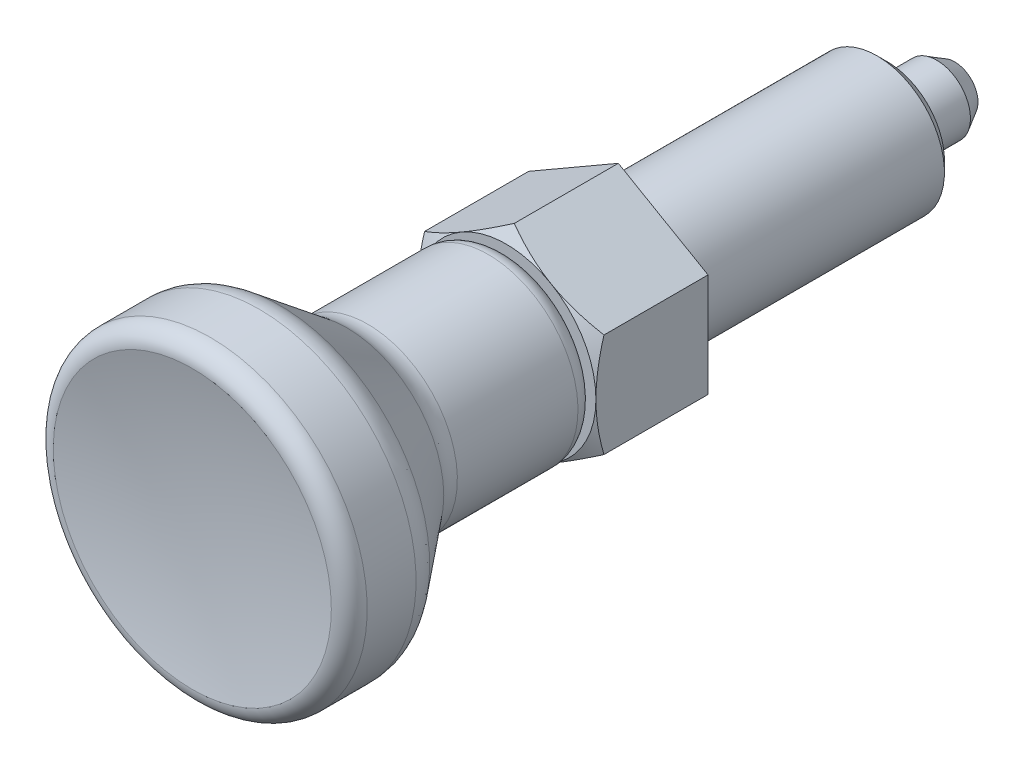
ISO-10303-21;
HEADER;
FILE_DESCRIPTION(('STEP AP214'),'2;1');
FILE_NAME('part.step','',(''),(''),'','','');
FILE_SCHEMA(('AUTOMOTIVE_DESIGN { 1 0 10303 214 1 1 1 1 }'));
ENDSEC;
DATA;
#1=APPLICATION_CONTEXT('core data for automotive mechanical design processes');
#2=APPLICATION_PROTOCOL_DEFINITION('international standard','automotive_design',2000,#1);
#3=PRODUCT_CONTEXT('',#1,'mechanical');
#4=PRODUCT('Part','Part','',(#3));
#5=PRODUCT_RELATED_PRODUCT_CATEGORY('part','',(#4));
#6=PRODUCT_DEFINITION_FORMATION('','',#4);
#7=PRODUCT_DEFINITION_CONTEXT('part definition',#1,'design');
#8=PRODUCT_DEFINITION('design','',#6,#7);
#9=PRODUCT_DEFINITION_SHAPE('','',#8);
#10=(LENGTH_UNIT() NAMED_UNIT(*) SI_UNIT(.MILLI.,.METRE.));
#11=(NAMED_UNIT(*) PLANE_ANGLE_UNIT() SI_UNIT($,.RADIAN.));
#12=(NAMED_UNIT(*) SI_UNIT($,.STERADIAN.) SOLID_ANGLE_UNIT());
#13=UNCERTAINTY_MEASURE_WITH_UNIT(LENGTH_MEASURE(1.E-05),#10,'distance_accuracy_value','');
#14=(GEOMETRIC_REPRESENTATION_CONTEXT(3) GLOBAL_UNCERTAINTY_ASSIGNED_CONTEXT((#13)) GLOBAL_UNIT_ASSIGNED_CONTEXT((#10,
#11,#12)) REPRESENTATION_CONTEXT('',''));
#15=CARTESIAN_POINT('',(0.,0.,0.));
#16=DIRECTION('',(0.,0.,1.));
#17=DIRECTION('',(1.,0.,0.));
#18=AXIS2_PLACEMENT_3D('',#15,#16,#17);
#19=CARTESIAN_POINT('',(0.,0.,3.2679491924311));
#20=DIRECTION('',(0.,0.,-1.));
#21=DIRECTION('',(1.,0.,0.));
#22=AXIS2_PLACEMENT_3D('',#19,#20,#21);
#23=CONICAL_SURFACE('',#22,7.,1.0471975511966);
#24=CARTESIAN_POINT('',(-4.,6.31761832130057,2.9922916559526));
#25=CARTESIAN_POINT('',(-4.,6.14192520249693,3.07797180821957));
#26=CARTESIAN_POINT('',(-4.,5.96584084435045,3.16286285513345));
#27=CARTESIAN_POINT('',(-4.,5.61268201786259,3.33062511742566));
#28=CARTESIAN_POINT('',(-4.,5.4356074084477,3.4134960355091));
#29=CARTESIAN_POINT('',(-4.,5.07940162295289,3.57716927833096));
#30=CARTESIAN_POINT('',(-4.,4.9002645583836,3.65795883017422));
#31=CARTESIAN_POINT('',(-4.,4.54060511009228,3.81638112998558));
#32=CARTESIAN_POINT('',(-4.,4.36008278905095,3.89401401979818));
#33=CARTESIAN_POINT('',(-4.,3.9911078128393,4.04790350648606));
#34=CARTESIAN_POINT('',(-4.,3.80259647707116,4.12402014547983));
#35=CARTESIAN_POINT('',(-4.,3.42341084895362,4.27076449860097));
#36=CARTESIAN_POINT('',(-4.,3.23273632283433,4.34139161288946));
#37=CARTESIAN_POINT('',(-4.,2.84924251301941,4.47538599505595));
#38=CARTESIAN_POINT('',(-4.,2.65642808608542,4.5387670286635));
#39=CARTESIAN_POINT('',(-4.,2.2680353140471,4.65631131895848));
#40=CARTESIAN_POINT('',(-4.,2.07245782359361,4.71047736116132));
#41=CARTESIAN_POINT('',(-4.,1.67954158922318,4.80677280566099));
#42=CARTESIAN_POINT('',(-4.,1.48222021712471,4.84897182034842));
#43=CARTESIAN_POINT('',(-4.,1.08500777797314,4.91903453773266));
#44=CARTESIAN_POINT('',(-4.,0.885116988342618,4.94689977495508));
#45=CARTESIAN_POINT('',(-4.,0.48641972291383,4.9857133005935));
#46=CARTESIAN_POINT('',(-4.,0.287635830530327,4.9968878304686));
#47=CARTESIAN_POINT('',(-4.,-0.110173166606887,5.00197590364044));
#48=CARTESIAN_POINT('',(-4.,-0.309198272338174,4.99588937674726));
#49=CARTESIAN_POINT('',(-4.,-0.643785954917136,4.97158820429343));
#50=CARTESIAN_POINT('',(-4.,-0.77969019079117,4.95777215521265));
#51=CARTESIAN_POINT('',(-4.,-1.05057142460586,4.92289191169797));
#52=CARTESIAN_POINT('',(-4.,-1.18554830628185,4.90182682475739));
#53=CARTESIAN_POINT('',(-4.,-1.58887088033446,4.82885810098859));
#54=CARTESIAN_POINT('',(-4.,-1.8554737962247,4.76719214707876));
#55=CARTESIAN_POINT('',(-4.,-2.2542740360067,4.65940087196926));
#56=CARTESIAN_POINT('',(-4.,-2.38851478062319,4.62039718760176));
#57=CARTESIAN_POINT('',(-4.,-2.65569482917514,4.53812259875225));
#58=CARTESIAN_POINT('',(-4.,-2.78863412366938,4.49485166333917));
#59=CARTESIAN_POINT('',(-4.,-3.05324930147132,4.40475468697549));
#60=CARTESIAN_POINT('',(-4.,-3.18492553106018,4.35792965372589));
#61=CARTESIAN_POINT('',(-4.,-3.44717271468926,4.26129676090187));
#62=CARTESIAN_POINT('',(-4.,-3.57774368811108,4.21148895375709));
#63=CARTESIAN_POINT('',(-4.,-3.90838583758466,4.08171887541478));
#64=CARTESIAN_POINT('',(-4.,-4.10778247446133,4.00004019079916));
#65=CARTESIAN_POINT('',(-4.,-4.50466534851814,3.83215118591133));
#66=CARTESIAN_POINT('',(-4.,-4.70215141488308,3.74594046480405));
#67=CARTESIAN_POINT('',(-4.,-5.09560571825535,3.56998451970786));
#68=CARTESIAN_POINT('',(-4.,-5.29157350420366,3.48023829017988));
#69=CARTESIAN_POINT('',(-4.,-5.68222178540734,3.29798176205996));
#70=CARTESIAN_POINT('',(-4.,-5.87690224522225,3.2054713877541));
#71=CARTESIAN_POINT('',(-4.,-6.45989965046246,2.92441834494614));
#72=CARTESIAN_POINT('',(-4.,-6.84663497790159,2.73259823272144));
#73=CARTESIAN_POINT('',(-4.,-7.61714397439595,2.34330251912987));
#74=CARTESIAN_POINT('',(-4.,-8.00091813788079,2.14582788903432));
#75=CARTESIAN_POINT('',(-4.,-8.72975807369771,1.76604091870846));
#76=CARTESIAN_POINT('',(-4.,-9.07501124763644,1.58408754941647));
#77=CARTESIAN_POINT('',(-4.,-9.76427122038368,1.21779786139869));
#78=CARTESIAN_POINT('',(-4.,-10.1082779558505,1.03346142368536));
#79=CARTESIAN_POINT('',(-4.,-10.7942722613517,0.663568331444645));
#80=CARTESIAN_POINT('',(-4.,-11.1362627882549,0.478017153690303));
#81=CARTESIAN_POINT('',(-4.,-11.8194584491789,0.105530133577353));
#82=CARTESIAN_POINT('',(-4.,-12.1606636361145,-0.0814056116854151));
#83=CARTESIAN_POINT('',(-4.,-12.5015869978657,-0.26885020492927));
#84=B_SPLINE_CURVE_WITH_KNOTS('',3,(#24,#25,#26,#27,#28,#29,#30,#31,#32,#33,#34,#35,#36,#37,#38,
#39,#40,#41,#42,#43,#44,#45,#46,#47,#48,#49,#50,#51,#52,#53,#54,#55,#56,#57,#58,#59,#60,#61,#62,
#63,#64,#65,#66,#67,#68,#69,#70,#71,#72,#73,#74,#75,#76,#77,#78,#79,#80,#81,#82,#83),
.UNSPECIFIED.,.F.,.F.,(4,2,2,2,2,2,2,2,2,2,2,2,2,2,2,2,2,2,2,2,2,2,2,2,2,2,2,2,2,4),(0.,
0.586421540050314,1.1729288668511,1.76244097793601,2.35192656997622,2.96175582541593,
3.5716516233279,4.18036881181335,4.78890166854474,5.39381845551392,5.99867046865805,
6.59524689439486,7.1918257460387,7.60144321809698,8.01111114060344,8.83085062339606,
9.25018861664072,9.66952964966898,10.0887522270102,10.5079674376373,11.1543192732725,
11.8007283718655,12.447322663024,13.0939346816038,14.3889300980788,15.6837043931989,
16.8544868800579,18.0253280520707,19.1925780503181,20.3597469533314),.UNSPECIFIED.);
#85=CARTESIAN_POINT('',(-4.,-2.3094010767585,4.64273441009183));
#86=VERTEX_POINT('',#85);
#87=CARTESIAN_POINT('',(-4.,0.,5.));
#88=VERTEX_POINT('',#87);
#89=EDGE_CURVE('E9',#86,#88,#84,.F.);
#90=ORIENTED_EDGE('',*,*,#89,.F.);
#91=CARTESIAN_POINT('',(0.000200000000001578,-4.61891762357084,4.64266774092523));
#92=CARTESIAN_POINT('',(-0.175579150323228,-4.5174314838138,4.70128212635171));
#93=CARTESIAN_POINT('',(-0.352875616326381,-4.41506932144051,4.75458967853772));
#94=CARTESIAN_POINT('',(-0.710538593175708,-4.20857250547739,4.84763832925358));
#95=CARTESIAN_POINT('',(-0.890911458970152,-4.10443418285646,4.88734651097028));
#96=CARTESIAN_POINT('',(-1.24942181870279,-3.89744813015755,4.9491577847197));
#97=CARTESIAN_POINT('',(-1.42750415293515,-3.79463224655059,4.97167226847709));
#98=CARTESIAN_POINT('',(-1.78450671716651,-3.58851671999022,4.9985493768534));
#99=CARTESIAN_POINT('',(-1.9634256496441,-3.48521782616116,5.00293425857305));
#100=CARTESIAN_POINT('',(-2.29774284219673,-3.29219970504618,4.99380992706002));
#101=CARTESIAN_POINT('',(-2.45319115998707,-3.20245157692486,4.98254104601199));
#102=CARTESIAN_POINT('',(-2.76307505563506,-3.02354002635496,4.94682600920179));
#103=CARTESIAN_POINT('',(-2.91750956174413,-2.93437722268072,4.92236765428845));
#104=CARTESIAN_POINT('',(-3.22803232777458,-2.75509682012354,4.86122393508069));
#105=CARTESIAN_POINT('',(-3.3840812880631,-2.6650019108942,4.82427939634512));
#106=CARTESIAN_POINT('',(-3.69385183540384,-2.486155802,4.74042992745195));
#107=CARTESIAN_POINT('',(-3.84757739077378,-2.39740231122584,4.69354469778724));
#108=CARTESIAN_POINT('',(-4.0002,-2.30928560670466,4.64266774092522));
#109=B_SPLINE_CURVE_WITH_KNOTS('',3,(#91,#92,#93,#94,#95,#96,#97,#98,#99,#100,#101,#102,#103,
#104,#105,#106,#107,#108),.UNSPECIFIED.,.F.,.F.,(4,2,2,2,2,2,2,2,4),(0.,0.634047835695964,
1.26961969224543,1.88946157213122,2.50854226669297,3.04757825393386,3.58711366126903,
4.13861653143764,4.68903648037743),.UNSPECIFIED.);
#110=CARTESIAN_POINT('',(-2.,-3.46410161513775,5.));
#111=VERTEX_POINT('',#110);
#112=EDGE_CURVE('E206',#111,#86,#109,.T.);
#113=ORIENTED_EDGE('',*,*,#112,.F.);
#114=CARTESIAN_POINT('',(0.,0.,5.));
#115=DIRECTION('',(0.,0.,1.));
#116=DIRECTION('',(-1.,0.,0.));
#117=AXIS2_PLACEMENT_3D('',#114,#115,#116);
#118=CIRCLE('',#117,4.);
#119=EDGE_CURVE('E124',#88,#111,#118,.T.);
#120=ORIENTED_EDGE('',*,*,#119,.F.);
#121=EDGE_LOOP('',(#90,#113,#120));
#122=FACE_BOUND('',#121,.T.);
#123=ADVANCED_FACE('F14',(#122),#23,.T.);
#124=CARTESIAN_POINT('',(-4.,2.3094010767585,4.64273441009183));
#125=VERTEX_POINT('',#124);
#126=EDGE_CURVE('E18',#88,#125,#84,.F.);
#127=ORIENTED_EDGE('',*,*,#126,.F.);
#128=CARTESIAN_POINT('',(-2.,3.46410161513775,5.));
#129=VERTEX_POINT('',#128);
#130=EDGE_CURVE('E116',#129,#88,#118,.T.);
#131=ORIENTED_EDGE('',*,*,#130,.F.);
#132=CARTESIAN_POINT('',(-4.0002,2.30928560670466,4.64266774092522));
#133=CARTESIAN_POINT('',(-3.82442084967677,2.4107717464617,4.7012821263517));
#134=CARTESIAN_POINT('',(-3.64712438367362,2.51313390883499,4.75458967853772));
#135=CARTESIAN_POINT('',(-3.28946140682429,2.71963072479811,4.84763832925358));
#136=CARTESIAN_POINT('',(-3.10908854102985,2.82376904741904,4.88734651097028));
#137=CARTESIAN_POINT('',(-2.75057818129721,3.03075510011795,4.9491577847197));
#138=CARTESIAN_POINT('',(-2.57249584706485,3.13357098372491,4.97167226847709));
#139=CARTESIAN_POINT('',(-2.21549328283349,3.33968651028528,4.99854937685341));
#140=CARTESIAN_POINT('',(-2.03657435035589,3.44298540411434,5.00293425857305));
#141=CARTESIAN_POINT('',(-1.70225715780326,3.63600352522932,4.99380992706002));
#142=CARTESIAN_POINT('',(-1.54680884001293,3.72575165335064,4.98254104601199));
#143=CARTESIAN_POINT('',(-1.23692494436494,3.90466320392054,4.94682600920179));
#144=CARTESIAN_POINT('',(-1.08249043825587,3.99382600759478,4.92236765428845));
#145=CARTESIAN_POINT('',(-0.771967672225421,4.17310641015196,4.8612239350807));
#146=CARTESIAN_POINT('',(-0.615918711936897,4.2632013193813,4.82427939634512));
#147=CARTESIAN_POINT('',(-0.30614816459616,4.4420474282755,4.74042992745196));
#148=CARTESIAN_POINT('',(-0.152422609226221,4.53080091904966,4.69354469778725));
#149=CARTESIAN_POINT('',(0.000199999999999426,4.61891762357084,4.64266774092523));
#150=B_SPLINE_CURVE_WITH_KNOTS('',3,(#132,#133,#134,#135,#136,#137,#138,#139,#140,#141,#142,
#143,#144,#145,#146,#147,#148,#149),.UNSPECIFIED.,.F.,.F.,(4,2,2,2,2,2,2,2,4),(0.,
0.634047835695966,1.26961969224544,1.88946157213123,2.50854226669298,3.04757825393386,
3.58711366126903,4.13861653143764,4.68903648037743),.UNSPECIFIED.);
#151=EDGE_CURVE('E265',#125,#129,#150,.T.);
#152=ORIENTED_EDGE('',*,*,#151,.F.);
#153=EDGE_LOOP('',(#127,#131,#152));
#154=FACE_BOUND('',#153,.T.);
#155=ADVANCED_FACE('F228',(#154),#23,.T.);
#156=CARTESIAN_POINT('',(0.,4.618802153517,4.64273441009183));
#157=VERTEX_POINT('',#156);
#158=EDGE_CURVE('E112',#129,#157,#150,.T.);
#159=ORIENTED_EDGE('',*,*,#158,.F.);
#160=CARTESIAN_POINT('',(2.,3.46410161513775,5.));
#161=VERTEX_POINT('',#160);
#162=EDGE_CURVE('E110',#161,#129,#118,.T.);
#163=ORIENTED_EDGE('',*,*,#162,.F.);
#164=CARTESIAN_POINT('',(-0.000200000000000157,4.61891762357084,4.64266774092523));
#165=CARTESIAN_POINT('',(0.17557915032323,4.5174314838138,4.70128212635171));
#166=CARTESIAN_POINT('',(0.352875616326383,4.41506932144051,4.75458967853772));
#167=CARTESIAN_POINT('',(0.710538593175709,4.20857250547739,4.84763832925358));
#168=CARTESIAN_POINT('',(0.890911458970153,4.10443418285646,4.88734651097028));
#169=CARTESIAN_POINT('',(1.24942181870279,3.89744813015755,4.94915778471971));
#170=CARTESIAN_POINT('',(1.42750415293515,3.79463224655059,4.97167226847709));
#171=CARTESIAN_POINT('',(1.78450671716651,3.58851671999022,4.99854937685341));
#172=CARTESIAN_POINT('',(1.9634256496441,3.48521782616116,5.00293425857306));
#173=CARTESIAN_POINT('',(2.29774284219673,3.29219970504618,4.99380992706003));
#174=CARTESIAN_POINT('',(2.45319115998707,3.20245157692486,4.982541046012));
#175=CARTESIAN_POINT('',(2.76307505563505,3.02354002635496,4.94682600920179));
#176=CARTESIAN_POINT('',(2.91750956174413,2.93437722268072,4.92236765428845));
#177=CARTESIAN_POINT('',(3.22803232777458,2.75509682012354,4.8612239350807));
#178=CARTESIAN_POINT('',(3.3840812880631,2.6650019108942,4.82427939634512));
#179=CARTESIAN_POINT('',(3.69385183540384,2.486155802,4.74042992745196));
#180=CARTESIAN_POINT('',(3.84757739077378,2.39740231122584,4.69354469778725));
#181=CARTESIAN_POINT('',(4.0002,2.30928560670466,4.64266774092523));
#182=B_SPLINE_CURVE_WITH_KNOTS('',3,(#164,#165,#166,#167,#168,#169,#170,#171,#172,#173,#174,
#175,#176,#177,#178,#179,#180,#181),.UNSPECIFIED.,.F.,.F.,(4,2,2,2,2,2,2,2,4),(0.,
0.634047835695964,1.26961969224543,1.88946157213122,2.50854226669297,3.04757825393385,
3.58711366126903,4.13861653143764,4.68903648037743),.UNSPECIFIED.);
#183=EDGE_CURVE('E90',#157,#161,#182,.T.);
#184=ORIENTED_EDGE('',*,*,#183,.F.);
#185=EDGE_LOOP('',(#159,#163,#184));
#186=FACE_BOUND('',#185,.T.);
#187=ADVANCED_FACE('F111',(#186),#23,.T.);
#188=CARTESIAN_POINT('',(0.,-4.618802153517,4.64273441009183));
#189=VERTEX_POINT('',#188);
#190=EDGE_CURVE('E201',#189,#111,#109,.T.);
#191=ORIENTED_EDGE('',*,*,#190,.F.);
#192=CARTESIAN_POINT('',(4.0002,-2.30928560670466,4.64266774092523));
#193=CARTESIAN_POINT('',(3.82442084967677,-2.4107717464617,4.70128212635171));
#194=CARTESIAN_POINT('',(3.64712438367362,-2.51313390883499,4.75458967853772));
#195=CARTESIAN_POINT('',(3.28946140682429,-2.71963072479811,4.84763832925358));
#196=CARTESIAN_POINT('',(3.10908854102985,-2.82376904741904,4.88734651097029));
#197=CARTESIAN_POINT('',(2.75057818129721,-3.03075510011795,4.94915778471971));
#198=CARTESIAN_POINT('',(2.57249584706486,-3.13357098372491,4.97167226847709));
#199=CARTESIAN_POINT('',(2.21549328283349,-3.33968651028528,4.99854937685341));
#200=CARTESIAN_POINT('',(2.0365743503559,-3.44298540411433,5.00293425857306));
#201=CARTESIAN_POINT('',(1.70225715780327,-3.63600352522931,4.99380992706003));
#202=CARTESIAN_POINT('',(1.54680884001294,-3.72575165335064,4.982541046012));
#203=CARTESIAN_POINT('',(1.23692494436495,-3.90466320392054,4.94682600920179));
#204=CARTESIAN_POINT('',(1.08249043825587,-3.99382600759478,4.92236765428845));
#205=CARTESIAN_POINT('',(0.771967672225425,-4.17310641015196,4.8612239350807));
#206=CARTESIAN_POINT('',(0.6159187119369,-4.2632013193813,4.82427939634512));
#207=CARTESIAN_POINT('',(0.306148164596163,-4.4420474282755,4.74042992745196));
#208=CARTESIAN_POINT('',(0.152422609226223,-4.53080091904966,4.69354469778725));
#209=CARTESIAN_POINT('',(-0.000199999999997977,-4.61891762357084,4.64266774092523));
#210=B_SPLINE_CURVE_WITH_KNOTS('',3,(#192,#193,#194,#195,#196,#197,#198,#199,#200,#201,#202,
#203,#204,#205,#206,#207,#208,#209),.UNSPECIFIED.,.F.,.F.,(4,2,2,2,2,2,2,2,4),(0.,
0.634047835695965,1.26961969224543,1.88946157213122,2.50854226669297,3.04757825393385,
3.58711366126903,4.13861653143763,4.68903648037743),.UNSPECIFIED.);
#211=CARTESIAN_POINT('',(2.,-3.46410161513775,5.));
#212=VERTEX_POINT('',#211);
#213=EDGE_CURVE('E100',#212,#189,#210,.T.);
#214=ORIENTED_EDGE('',*,*,#213,.F.);
#215=EDGE_CURVE('E123',#111,#212,#118,.T.);
#216=ORIENTED_EDGE('',*,*,#215,.F.);
#217=EDGE_LOOP('',(#191,#214,#216));
#218=FACE_BOUND('',#217,.T.);
#219=ADVANCED_FACE('F246',(#218),#23,.T.);
#220=CARTESIAN_POINT('',(4.,2.3094010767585,4.64273441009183));
#221=VERTEX_POINT('',#220);
#222=EDGE_CURVE('E94',#161,#221,#182,.T.);
#223=ORIENTED_EDGE('',*,*,#222,.F.);
#224=CARTESIAN_POINT('',(4.,0.,5.));
#225=VERTEX_POINT('',#224);
#226=EDGE_CURVE('E106',#225,#161,#118,.T.);
#227=ORIENTED_EDGE('',*,*,#226,.F.);
#228=CARTESIAN_POINT('',(4.,6.31761832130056,2.9922916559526));
#229=CARTESIAN_POINT('',(4.,6.14192520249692,3.07797180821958));
#230=CARTESIAN_POINT('',(4.,5.96584084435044,3.16286285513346));
#231=CARTESIAN_POINT('',(4.,5.61268201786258,3.33062511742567));
#232=CARTESIAN_POINT('',(4.,5.4356074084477,3.4134960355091));
#233=CARTESIAN_POINT('',(4.,5.07940162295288,3.57716927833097));
#234=CARTESIAN_POINT('',(4.,4.9002645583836,3.65795883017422));
#235=CARTESIAN_POINT('',(4.,4.54060511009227,3.81638112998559));
#236=CARTESIAN_POINT('',(4.,4.36008278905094,3.89401401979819));
#237=CARTESIAN_POINT('',(4.,3.9911078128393,4.04790350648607));
#238=CARTESIAN_POINT('',(4.,3.80259647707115,4.12402014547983));
#239=CARTESIAN_POINT('',(4.,3.42341084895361,4.27076449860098));
#240=CARTESIAN_POINT('',(4.,3.23273632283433,4.34139161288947));
#241=CARTESIAN_POINT('',(4.,2.84924251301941,4.47538599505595));
#242=CARTESIAN_POINT('',(4.,2.65642808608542,4.5387670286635));
#243=CARTESIAN_POINT('',(4.,2.2680353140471,4.65631131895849));
#244=CARTESIAN_POINT('',(4.,2.07245782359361,4.71047736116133));
#245=CARTESIAN_POINT('',(4.,1.67954158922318,4.806772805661));
#246=CARTESIAN_POINT('',(4.,1.48222021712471,4.84897182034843));
#247=CARTESIAN_POINT('',(4.,1.08500777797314,4.91903453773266));
#248=CARTESIAN_POINT('',(4.,0.885116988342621,4.94689977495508));
#249=CARTESIAN_POINT('',(4.,0.486419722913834,4.98571330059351));
#250=CARTESIAN_POINT('',(4.,0.287635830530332,4.9968878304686));
#251=CARTESIAN_POINT('',(4.,-0.110173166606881,5.00197590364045));
#252=CARTESIAN_POINT('',(4.,-0.309198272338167,4.99588937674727));
#253=CARTESIAN_POINT('',(4.,-0.643785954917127,4.97158820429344));
#254=CARTESIAN_POINT('',(4.,-0.779690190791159,4.95777215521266));
#255=CARTESIAN_POINT('',(4.,-1.05057142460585,4.92289191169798));
#256=CARTESIAN_POINT('',(4.,-1.18554830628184,4.9018268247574));
#257=CARTESIAN_POINT('',(4.,-1.58887088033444,4.82885810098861));
#258=CARTESIAN_POINT('',(4.,-1.85547379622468,4.76719214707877));
#259=CARTESIAN_POINT('',(4.,-2.25427403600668,4.65940087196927));
#260=CARTESIAN_POINT('',(4.,-2.38851478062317,4.62039718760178));
#261=CARTESIAN_POINT('',(4.,-2.65569482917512,4.53812259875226));
#262=CARTESIAN_POINT('',(4.,-2.78863412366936,4.49485166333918));
#263=CARTESIAN_POINT('',(4.,-3.0532493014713,4.40475468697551));
#264=CARTESIAN_POINT('',(4.,-3.18492553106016,4.35792965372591));
#265=CARTESIAN_POINT('',(4.,-3.44717271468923,4.26129676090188));
#266=CARTESIAN_POINT('',(4.,-3.57774368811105,4.2114889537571));
#267=CARTESIAN_POINT('',(4.,-3.90838583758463,4.0817188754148));
#268=CARTESIAN_POINT('',(4.,-4.10778247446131,4.00004019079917));
#269=CARTESIAN_POINT('',(4.,-4.50466534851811,3.83215118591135));
#270=CARTESIAN_POINT('',(4.,-4.70215141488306,3.74594046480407));
#271=CARTESIAN_POINT('',(4.,-5.09560571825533,3.56998451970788));
#272=CARTESIAN_POINT('',(4.,-5.29157350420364,3.48023829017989));
#273=CARTESIAN_POINT('',(4.,-5.68222178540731,3.29798176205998));
#274=CARTESIAN_POINT('',(4.,-5.87690224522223,3.20547138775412));
#275=CARTESIAN_POINT('',(4.,-6.45989965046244,2.92441834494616));
#276=CARTESIAN_POINT('',(4.,-6.84663497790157,2.73259823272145));
#277=CARTESIAN_POINT('',(4.,-7.61714397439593,2.34330251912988));
#278=CARTESIAN_POINT('',(4.,-8.00091813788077,2.14582788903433));
#279=CARTESIAN_POINT('',(4.,-8.72975807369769,1.76604091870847));
#280=CARTESIAN_POINT('',(4.,-9.07501124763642,1.58408754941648));
#281=CARTESIAN_POINT('',(4.,-9.76427122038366,1.2177978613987));
#282=CARTESIAN_POINT('',(4.,-10.1082779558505,1.03346142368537));
#283=CARTESIAN_POINT('',(4.,-10.7942722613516,0.66356833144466));
#284=CARTESIAN_POINT('',(4.,-11.1362627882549,0.478017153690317));
#285=CARTESIAN_POINT('',(4.,-11.8194584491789,0.105530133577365));
#286=CARTESIAN_POINT('',(4.,-12.1606636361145,-0.0814056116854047));
#287=CARTESIAN_POINT('',(4.,-12.5015869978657,-0.268850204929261));
#288=B_SPLINE_CURVE_WITH_KNOTS('',3,(#228,#229,#230,#231,#232,#233,#234,#235,#236,#237,#238,
#239,#240,#241,#242,#243,#244,#245,#246,#247,#248,#249,#250,#251,#252,#253,#254,#255,#256,#257,
#258,#259,#260,#261,#262,#263,#264,#265,#266,#267,#268,#269,#270,#271,#272,#273,#274,#275,#276,
#277,#278,#279,#280,#281,#282,#283,#284,#285,#286,#287),.UNSPECIFIED.,.F.,.F.,(4,2,2,2,2,2,2,2,
2,2,2,2,2,2,2,2,2,2,2,2,2,2,2,2,2,2,2,2,2,4),(0.,0.586421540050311,1.1729288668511,
1.762440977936,2.35192656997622,2.96175582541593,3.57165162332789,4.18036881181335,
4.78890166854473,5.39381845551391,5.99867046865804,6.59524689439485,7.19182574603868,
7.60144321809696,8.01111114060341,8.83085062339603,9.25018861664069,9.66952964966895,
10.0887522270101,10.5079674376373,11.1543192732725,11.8007283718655,12.4473226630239,
13.0939346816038,14.3889300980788,15.6837043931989,16.8544868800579,18.0253280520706,
19.1925780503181,20.3597469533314),.UNSPECIFIED.);
#289=EDGE_CURVE('E41',#221,#225,#288,.T.);
#290=ORIENTED_EDGE('',*,*,#289,.F.);
#291=EDGE_LOOP('',(#223,#227,#290));
#292=FACE_BOUND('',#291,.T.);
#293=ADVANCED_FACE('F104',(#292),#23,.T.);
#294=CARTESIAN_POINT('',(4.,-2.3094010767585,4.64273441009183));
#295=VERTEX_POINT('',#294);
#296=EDGE_CURVE('E108',#295,#212,#210,.T.);
#297=ORIENTED_EDGE('',*,*,#296,.F.);
#298=EDGE_CURVE('E171',#225,#295,#288,.T.);
#299=ORIENTED_EDGE('',*,*,#298,.F.);
#300=EDGE_CURVE('E122',#212,#225,#118,.T.);
#301=ORIENTED_EDGE('',*,*,#300,.F.);
#302=EDGE_LOOP('',(#297,#299,#301));
#303=FACE_BOUND('',#302,.T.);
#304=ADVANCED_FACE('F230',(#303),#23,.T.);
#305=CARTESIAN_POINT('',(-6.91996876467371E-12,0.,48.3523423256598));
#306=DIRECTION('',(0.,0.,1.));
#307=DIRECTION('',(1.,0.,0.));
#308=AXIS2_PLACEMENT_3D('',#305,#306,#307);
#309=SPHERICAL_SURFACE('',#308,30.0000000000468);
#310=CARTESIAN_POINT('',(0.,0.,19.));
#311=DIRECTION('',(0.,0.,1.));
#312=DIRECTION('',(0.,-1.,0.));
#313=AXIS2_PLACEMENT_3D('',#310,#311,#312);
#314=CIRCLE('',#313,6.2000000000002);
#315=CARTESIAN_POINT('',(0.,-6.2000000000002,19.));
#316=VERTEX_POINT('',#315);
#317=EDGE_CURVE('E168',#316,#316,#314,.T.);
#318=ORIENTED_EDGE('',*,*,#317,.T.);
#319=EDGE_LOOP('',(#318));
#320=FACE_BOUND('',#319,.T.);
#321=ADVANCED_FACE('F16',(#320),#309,.F.);
#322=CARTESIAN_POINT('',(0.,0.,18.1999999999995));
#323=DIRECTION('',(0.,0.,1.));
#324=DIRECTION('',(0.,-1.,0.));
#325=AXIS2_PLACEMENT_3D('',#322,#323,#324);
#326=TOROIDAL_SURFACE('',#325,6.19999999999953,0.800000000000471);
#327=CARTESIAN_POINT('',(0.,0.,18.1999999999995));
#328=DIRECTION('',(0.,0.,1.));
#329=DIRECTION('',(0.,-1.,0.));
#330=AXIS2_PLACEMENT_3D('',#327,#328,#329);
#331=CIRCLE('',#330,7.);
#332=CARTESIAN_POINT('',(0.,-7.,18.1999999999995));
#333=VERTEX_POINT('',#332);
#334=EDGE_CURVE('E165',#333,#333,#331,.T.);
#335=ORIENTED_EDGE('',*,*,#334,.T.);
#336=EDGE_LOOP('',(#335));
#337=FACE_BOUND('',#336,.T.);
#338=ORIENTED_EDGE('',*,*,#317,.F.);
#339=EDGE_LOOP('',(#338));
#340=FACE_BOUND('',#339,.T.);
#341=ADVANCED_FACE('F244',(#337,#340),#326,.T.);
#342=CARTESIAN_POINT('',(0.,0.,-95.));
#343=DIRECTION('',(0.,0.,1.));
#344=DIRECTION('',(0.,-1.,0.));
#345=AXIS2_PLACEMENT_3D('',#342,#343,#344);
#346=CYLINDRICAL_SURFACE('',#345,7.);
#347=CARTESIAN_POINT('',(0.,0.,16.020743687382));
#348=DIRECTION('',(0.,0.,1.));
#349=DIRECTION('',(0.,-1.,0.));
#350=AXIS2_PLACEMENT_3D('',#347,#348,#349);
#351=CIRCLE('',#350,7.);
#352=CARTESIAN_POINT('',(0.,-7.,16.020743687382));
#353=VERTEX_POINT('',#352);
#354=EDGE_CURVE('E162',#353,#353,#351,.T.);
#355=ORIENTED_EDGE('',*,*,#354,.T.);
#356=EDGE_LOOP('',(#355));
#357=FACE_BOUND('',#356,.T.);
#358=ORIENTED_EDGE('',*,*,#334,.F.);
#359=EDGE_LOOP('',(#358));
#360=FACE_BOUND('',#359,.T.);
#361=ADVANCED_FACE('F343',(#357,#360),#346,.T.);
#362=CARTESIAN_POINT('',(0.,0.,16.020743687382));
#363=DIRECTION('',(0.,0.,1.));
#364=DIRECTION('',(0.,-1.,0.));
#365=AXIS2_PLACEMENT_3D('',#362,#363,#364);
#366=TOROIDAL_SURFACE('',#365,5.50000000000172,1.49999999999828);
#367=CARTESIAN_POINT('',(0.,0.,15.091277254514));
#368=DIRECTION('',(0.,0.,1.));
#369=DIRECTION('',(0.,-1.,0.));
#370=AXIS2_PLACEMENT_3D('',#367,#368,#369);
#371=CIRCLE('',#370,6.6773241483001);
#372=CARTESIAN_POINT('',(0.,-6.6773241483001,15.091277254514));
#373=VERTEX_POINT('',#372);
#374=EDGE_CURVE('E159',#373,#373,#371,.T.);
#375=ORIENTED_EDGE('',*,*,#374,.T.);
#376=EDGE_LOOP('',(#375));
#377=FACE_BOUND('',#376,.T.);
#378=ORIENTED_EDGE('',*,*,#354,.F.);
#379=EDGE_LOOP('',(#378));
#380=FACE_BOUND('',#379,.T.);
#381=ADVANCED_FACE('F339',(#377,#380),#366,.T.);
#382=CARTESIAN_POINT('',(0.,0.,15.091277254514));
#383=DIRECTION('',(0.,0.,1.));
#384=DIRECTION('',(0.,-1.,0.));
#385=AXIS2_PLACEMENT_3D('',#382,#383,#384);
#386=CONICAL_SURFACE('',#385,6.6773241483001,0.668289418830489);
#387=CARTESIAN_POINT('',(0.,0.,12.1087227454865));
#388=DIRECTION('',(0.,0.,1.));
#389=DIRECTION('',(0.,-1.,0.));
#390=AXIS2_PLACEMENT_3D('',#387,#388,#389);
#391=CIRCLE('',#390,4.3226758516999);
#392=CARTESIAN_POINT('',(0.,-4.3226758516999,12.1087227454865));
#393=VERTEX_POINT('',#392);
#394=EDGE_CURVE('E156',#393,#393,#391,.T.);
#395=ORIENTED_EDGE('',*,*,#394,.T.);
#396=EDGE_LOOP('',(#395));
#397=FACE_BOUND('',#396,.T.);
#398=ORIENTED_EDGE('',*,*,#374,.F.);
#399=EDGE_LOOP('',(#398));
#400=FACE_BOUND('',#399,.T.);
#401=ADVANCED_FACE('F335',(#397,#400),#386,.T.);
#402=CARTESIAN_POINT('',(0.,0.,11.1792563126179));
#403=DIRECTION('',(0.,0.,1.));
#404=DIRECTION('',(0.,-1.,0.));
#405=AXIS2_PLACEMENT_3D('',#402,#403,#404);
#406=TOROIDAL_SURFACE('',#405,5.5,1.49999999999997);
#407=CARTESIAN_POINT('',(0.,0.,11.179256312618));
#408=DIRECTION('',(0.,0.,1.));
#409=DIRECTION('',(0.,-1.,0.));
#410=AXIS2_PLACEMENT_3D('',#407,#408,#409);
#411=CIRCLE('',#410,4.);
#412=CARTESIAN_POINT('',(0.,-4.,11.179256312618));
#413=VERTEX_POINT('',#412);
#414=EDGE_CURVE('E153',#413,#413,#411,.T.);
#415=ORIENTED_EDGE('',*,*,#414,.T.);
#416=EDGE_LOOP('',(#415));
#417=FACE_BOUND('',#416,.T.);
#418=ORIENTED_EDGE('',*,*,#394,.F.);
#419=EDGE_LOOP('',(#418));
#420=FACE_BOUND('',#419,.T.);
#421=ADVANCED_FACE('F331',(#417,#420),#406,.F.);
#422=CARTESIAN_POINT('',(0.,0.,-95.));
#423=DIRECTION('',(0.,0.,1.));
#424=DIRECTION('',(0.,-1.,0.));
#425=AXIS2_PLACEMENT_3D('',#422,#423,#424);
#426=CYLINDRICAL_SURFACE('',#425,4.);
#427=CARTESIAN_POINT('',(0.,0.,5.8));
#428=DIRECTION('',(0.,0.,1.));
#429=DIRECTION('',(0.,-1.,0.));
#430=AXIS2_PLACEMENT_3D('',#427,#428,#429);
#431=CIRCLE('',#430,4.);
#432=CARTESIAN_POINT('',(0.,-4.,5.8));
#433=VERTEX_POINT('',#432);
#434=EDGE_CURVE('E150',#433,#433,#431,.T.);
#435=ORIENTED_EDGE('',*,*,#434,.T.);
#436=EDGE_LOOP('',(#435));
#437=FACE_BOUND('',#436,.T.);
#438=ORIENTED_EDGE('',*,*,#414,.F.);
#439=EDGE_LOOP('',(#438));
#440=FACE_BOUND('',#439,.T.);
#441=ADVANCED_FACE('F327',(#437,#440),#426,.T.);
#442=CARTESIAN_POINT('',(0.,0.,5.80000000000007));
#443=DIRECTION('',(0.,0.,1.));
#444=DIRECTION('',(0.,-1.,0.));
#445=AXIS2_PLACEMENT_3D('',#442,#443,#444);
#446=TOROIDAL_SURFACE('',#445,3.19999999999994,0.800000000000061);
#447=CARTESIAN_POINT('',(0.,0.,5.));
#448=DIRECTION('',(0.,0.,1.));
#449=DIRECTION('',(0.,-1.,0.));
#450=AXIS2_PLACEMENT_3D('',#447,#448,#449);
#451=CIRCLE('',#450,3.2);
#452=CARTESIAN_POINT('',(0.,-3.2,5.));
#453=VERTEX_POINT('',#452);
#454=EDGE_CURVE('E147',#453,#453,#451,.T.);
#455=ORIENTED_EDGE('',*,*,#454,.T.);
#456=EDGE_LOOP('',(#455));
#457=FACE_BOUND('',#456,.T.);
#458=ORIENTED_EDGE('',*,*,#434,.F.);
#459=EDGE_LOOP('',(#458));
#460=FACE_BOUND('',#459,.T.);
#461=ADVANCED_FACE('F313',(#457,#460),#446,.T.);
#462=CARTESIAN_POINT('',(4.,0.,5.));
#463=DIRECTION('',(0.,0.,-1.));
#464=DIRECTION('',(1.,0.,0.));
#465=AXIS2_PLACEMENT_3D('',#462,#463,#464);
#466=PLANE('',#465);
#467=ORIENTED_EDGE('',*,*,#454,.F.);
#468=EDGE_LOOP('',(#467));
#469=FACE_BOUND('',#468,.T.);
#470=ORIENTED_EDGE('',*,*,#119,.T.);
#471=ORIENTED_EDGE('',*,*,#215,.T.);
#472=ORIENTED_EDGE('',*,*,#300,.T.);
#473=ORIENTED_EDGE('',*,*,#226,.T.);
#474=ORIENTED_EDGE('',*,*,#162,.T.);
#475=ORIENTED_EDGE('',*,*,#130,.T.);
#476=EDGE_LOOP('',(#470,#471,#472,#473,#474,#475));
#477=FACE_BOUND('',#476,.T.);
#478=ADVANCED_FACE('F119',(#469,#477),#466,.F.);
#479=CARTESIAN_POINT('',(4.,2.3094010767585,-2.));
#480=DIRECTION('',(0.5,0.866025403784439,0.));
#481=DIRECTION('',(-0.866025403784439,0.5,0.));
#482=AXIS2_PLACEMENT_3D('',#479,#480,#481);
#483=PLANE('',#482);
#484=DIRECTION('',(-0.866025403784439,0.5,0.));
#485=VECTOR('',#484,1.);
#486=CARTESIAN_POINT('',(4.25,2.1650635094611,0.));
#487=LINE('',#486,#485);
#488=CARTESIAN_POINT('',(4.,2.3094010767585,0.));
#489=VERTEX_POINT('',#488);
#490=CARTESIAN_POINT('',(0.,4.618802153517,0.));
#491=VERTEX_POINT('',#490);
#492=EDGE_CURVE('E128',#489,#491,#487,.T.);
#493=ORIENTED_EDGE('',*,*,#492,.T.);
#494=DIRECTION('',(0.,0.,1.));
#495=VECTOR('',#494,1.);
#496=CARTESIAN_POINT('',(0.,4.618802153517,-2.));
#497=LINE('',#496,#495);
#498=EDGE_CURVE('E96',#491,#157,#497,.T.);
#499=ORIENTED_EDGE('',*,*,#498,.T.);
#500=ORIENTED_EDGE('',*,*,#183,.T.);
#501=ORIENTED_EDGE('',*,*,#222,.T.);
#502=DIRECTION('',(0.,0.,1.));
#503=VECTOR('',#502,1.);
#504=CARTESIAN_POINT('',(4.,2.3094010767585,-2.));
#505=LINE('',#504,#503);
#506=EDGE_CURVE('E286',#489,#221,#505,.T.);
#507=ORIENTED_EDGE('',*,*,#506,.F.);
#508=EDGE_LOOP('',(#493,#499,#500,#501,#507));
#509=FACE_BOUND('',#508,.T.);
#510=ADVANCED_FACE('F92',(#509),#483,.T.);
#511=CARTESIAN_POINT('',(0.,4.618802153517,-2.));
#512=DIRECTION('',(-0.5,0.866025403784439,0.));
#513=DIRECTION('',(-0.866025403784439,-0.5,0.));
#514=AXIS2_PLACEMENT_3D('',#511,#512,#513);
#515=PLANE('',#514);
#516=DIRECTION('',(-0.866025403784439,-0.5,0.));
#517=VECTOR('',#516,1.);
#518=CARTESIAN_POINT('',(0.250000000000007,4.76313972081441,0.));
#519=LINE('',#518,#517);
#520=CARTESIAN_POINT('',(-4.,2.3094010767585,0.));
#521=VERTEX_POINT('',#520);
#522=EDGE_CURVE('E269',#491,#521,#519,.T.);
#523=ORIENTED_EDGE('',*,*,#522,.T.);
#524=DIRECTION('',(0.,0.,1.));
#525=VECTOR('',#524,1.);
#526=CARTESIAN_POINT('',(-4.,2.3094010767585,-2.));
#527=LINE('',#526,#525);
#528=EDGE_CURVE('E272',#521,#125,#527,.T.);
#529=ORIENTED_EDGE('',*,*,#528,.T.);
#530=ORIENTED_EDGE('',*,*,#151,.T.);
#531=ORIENTED_EDGE('',*,*,#158,.T.);
#532=ORIENTED_EDGE('',*,*,#498,.F.);
#533=EDGE_LOOP('',(#523,#529,#530,#531,#532));
#534=FACE_BOUND('',#533,.T.);
#535=ADVANCED_FACE('F195',(#534),#515,.T.);
#536=CARTESIAN_POINT('',(-4.,2.3094010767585,-2.));
#537=DIRECTION('',(-1.,0.,0.));
#538=DIRECTION('',(0.,-1.,0.));
#539=AXIS2_PLACEMENT_3D('',#536,#537,#538);
#540=PLANE('',#539);
#541=DIRECTION('',(0.,-1.,0.));
#542=VECTOR('',#541,1.);
#543=CARTESIAN_POINT('',(-4.,0.,0.));
#544=LINE('',#543,#542);
#545=CARTESIAN_POINT('',(-4.,-2.3094010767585,0.));
#546=VERTEX_POINT('',#545);
#547=EDGE_CURVE('E279',#521,#546,#544,.T.);
#548=ORIENTED_EDGE('',*,*,#547,.T.);
#549=DIRECTION('',(0.,0.,1.));
#550=VECTOR('',#549,1.);
#551=CARTESIAN_POINT('',(-4.,-2.3094010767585,-2.));
#552=LINE('',#551,#550);
#553=EDGE_CURVE('E261',#546,#86,#552,.T.);
#554=ORIENTED_EDGE('',*,*,#553,.T.);
#555=ORIENTED_EDGE('',*,*,#89,.T.);
#556=ORIENTED_EDGE('',*,*,#126,.T.);
#557=ORIENTED_EDGE('',*,*,#528,.F.);
#558=EDGE_LOOP('',(#548,#554,#555,#556,#557));
#559=FACE_BOUND('',#558,.T.);
#560=ADVANCED_FACE('F215',(#559),#540,.T.);
#561=CARTESIAN_POINT('',(-4.,-2.3094010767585,-2.));
#562=DIRECTION('',(-0.5,-0.866025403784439,0.));
#563=DIRECTION('',(0.866025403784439,-0.5,0.));
#564=AXIS2_PLACEMENT_3D('',#561,#562,#563);
#565=PLANE('',#564);
#566=DIRECTION('',(0.866025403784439,-0.5,0.));
#567=VECTOR('',#566,1.);
#568=CARTESIAN_POINT('',(0.250000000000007,-4.76313972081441,0.));
#569=LINE('',#568,#567);
#570=CARTESIAN_POINT('',(0.,-4.618802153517,0.));
#571=VERTEX_POINT('',#570);
#572=EDGE_CURVE('E260',#546,#571,#569,.T.);
#573=ORIENTED_EDGE('',*,*,#572,.T.);
#574=DIRECTION('',(0.,0.,1.));
#575=VECTOR('',#574,1.);
#576=CARTESIAN_POINT('',(0.,-4.618802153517,-2.));
#577=LINE('',#576,#575);
#578=EDGE_CURVE('E252',#571,#189,#577,.T.);
#579=ORIENTED_EDGE('',*,*,#578,.T.);
#580=ORIENTED_EDGE('',*,*,#190,.T.);
#581=ORIENTED_EDGE('',*,*,#112,.T.);
#582=ORIENTED_EDGE('',*,*,#553,.F.);
#583=EDGE_LOOP('',(#573,#579,#580,#581,#582));
#584=FACE_BOUND('',#583,.T.);
#585=ADVANCED_FACE('F212',(#584),#565,.T.);
#586=CARTESIAN_POINT('',(0.,-4.618802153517,-2.));
#587=DIRECTION('',(0.5,-0.866025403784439,0.));
#588=DIRECTION('',(0.866025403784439,0.5,0.));
#589=AXIS2_PLACEMENT_3D('',#586,#587,#588);
#590=PLANE('',#589);
#591=DIRECTION('',(0.866025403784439,0.5,0.));
#592=VECTOR('',#591,1.);
#593=CARTESIAN_POINT('',(4.25,-2.1650635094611,0.));
#594=LINE('',#593,#592);
#595=CARTESIAN_POINT('',(4.,-2.3094010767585,0.));
#596=VERTEX_POINT('',#595);
#597=EDGE_CURVE('E283',#571,#596,#594,.T.);
#598=ORIENTED_EDGE('',*,*,#597,.T.);
#599=DIRECTION('',(0.,0.,1.));
#600=VECTOR('',#599,1.);
#601=CARTESIAN_POINT('',(4.,-2.3094010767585,-2.));
#602=LINE('',#601,#600);
#603=EDGE_CURVE('E35',#596,#295,#602,.T.);
#604=ORIENTED_EDGE('',*,*,#603,.T.);
#605=ORIENTED_EDGE('',*,*,#296,.T.);
#606=ORIENTED_EDGE('',*,*,#213,.T.);
#607=ORIENTED_EDGE('',*,*,#578,.F.);
#608=EDGE_LOOP('',(#598,#604,#605,#606,#607));
#609=FACE_BOUND('',#608,.T.);
#610=ADVANCED_FACE('F190',(#609),#590,.T.);
#611=CARTESIAN_POINT('',(4.,-2.3094010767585,-2.));
#612=DIRECTION('',(1.,0.,0.));
#613=DIRECTION('',(0.,1.,0.));
#614=AXIS2_PLACEMENT_3D('',#611,#612,#613);
#615=PLANE('',#614);
#616=DIRECTION('',(0.,1.,0.));
#617=VECTOR('',#616,1.);
#618=CARTESIAN_POINT('',(4.,0.,0.));
#619=LINE('',#618,#617);
#620=EDGE_CURVE('E271',#596,#489,#619,.T.);
#621=ORIENTED_EDGE('',*,*,#620,.T.);
#622=ORIENTED_EDGE('',*,*,#506,.T.);
#623=ORIENTED_EDGE('',*,*,#289,.T.);
#624=ORIENTED_EDGE('',*,*,#298,.T.);
#625=ORIENTED_EDGE('',*,*,#603,.F.);
#626=EDGE_LOOP('',(#621,#622,#623,#624,#625));
#627=FACE_BOUND('',#626,.T.);
#628=ADVANCED_FACE('F186',(#627),#615,.T.);
#629=CARTESIAN_POINT('',(1.0381197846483,0.,-15.));
#630=DIRECTION('',(0.,0.,-1.));
#631=DIRECTION('',(0.,1.,0.));
#632=AXIS2_PLACEMENT_3D('',#629,#630,#631);
#633=PLANE('',#632);
#634=CARTESIAN_POINT('',(0.,0.,-15.));
#635=DIRECTION('',(0.,0.,1.));
#636=DIRECTION('',(0.,-1.,0.));
#637=AXIS2_PLACEMENT_3D('',#634,#635,#636);
#638=CIRCLE('',#637,1.0381197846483);
#639=CARTESIAN_POINT('',(0.,-1.0381197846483,-15.));
#640=VERTEX_POINT('',#639);
#641=EDGE_CURVE('E141',#640,#640,#638,.T.);
#642=ORIENTED_EDGE('',*,*,#641,.F.);
#643=EDGE_LOOP('',(#642));
#644=FACE_BOUND('',#643,.T.);
#645=ADVANCED_FACE('F189',(#644),#633,.T.);
#646=CARTESIAN_POINT('',(0.,0.,-14.2));
#647=DIRECTION('',(0.,0.,1.));
#648=DIRECTION('',(0.,-1.,0.));
#649=AXIS2_PLACEMENT_3D('',#646,#647,#648);
#650=CONICAL_SURFACE('',#649,1.5,0.523598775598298);
#651=ORIENTED_EDGE('',*,*,#641,.T.);
#652=EDGE_LOOP('',(#651));
#653=FACE_BOUND('',#652,.T.);
#654=CARTESIAN_POINT('',(0.,0.,-14.2));
#655=DIRECTION('',(0.,0.,1.));
#656=DIRECTION('',(0.,-1.,0.));
#657=AXIS2_PLACEMENT_3D('',#654,#655,#656);
#658=CIRCLE('',#657,1.5);
#659=CARTESIAN_POINT('',(0.,-1.5,-14.2));
#660=VERTEX_POINT('',#659);
#661=EDGE_CURVE('E144',#660,#660,#658,.T.);
#662=ORIENTED_EDGE('',*,*,#661,.F.);
#663=EDGE_LOOP('',(#662));
#664=FACE_BOUND('',#663,.T.);
#665=ADVANCED_FACE('F317',(#653,#664),#650,.T.);
#666=CARTESIAN_POINT('',(0.,0.,-95.));
#667=DIRECTION('',(0.,0.,1.));
#668=DIRECTION('',(0.,-1.,0.));
#669=AXIS2_PLACEMENT_3D('',#666,#667,#668);
#670=CYLINDRICAL_SURFACE('',#669,1.5);
#671=ORIENTED_EDGE('',*,*,#661,.T.);
#672=EDGE_LOOP('',(#671));
#673=FACE_BOUND('',#672,.T.);
#674=CARTESIAN_POINT('',(0.,0.,-12.));
#675=DIRECTION('',(0.,0.,1.));
#676=DIRECTION('',(-1.,0.,0.));
#677=AXIS2_PLACEMENT_3D('',#674,#675,#676);
#678=CIRCLE('',#677,1.5);
#679=CARTESIAN_POINT('',(-1.49999999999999,0.,-12.));
#680=VERTEX_POINT('',#679);
#681=EDGE_CURVE('E138',#680,#680,#678,.T.);
#682=ORIENTED_EDGE('',*,*,#681,.F.);
#683=EDGE_LOOP('',(#682));
#684=FACE_BOUND('',#683,.T.);
#685=ADVANCED_FACE('F309',(#673,#684),#670,.T.);
#686=CARTESIAN_POINT('',(1.5,0.,-12.));
#687=DIRECTION('',(0.,0.,1.));
#688=DIRECTION('',(-1.,0.,0.));
#689=AXIS2_PLACEMENT_3D('',#686,#687,#688);
#690=PLANE('',#689);
#691=CARTESIAN_POINT('',(0.,0.,-12.));
#692=DIRECTION('',(0.,0.,1.));
#693=DIRECTION('',(-1.,0.,0.));
#694=AXIS2_PLACEMENT_3D('',#691,#692,#693);
#695=CIRCLE('',#694,2.54);
#696=CARTESIAN_POINT('',(-2.54,0.,-12.));
#697=VERTEX_POINT('',#696);
#698=EDGE_CURVE('E135',#697,#697,#695,.T.);
#699=ORIENTED_EDGE('',*,*,#698,.F.);
#700=EDGE_LOOP('',(#699));
#701=FACE_BOUND('',#700,.T.);
#702=ORIENTED_EDGE('',*,*,#681,.T.);
#703=EDGE_LOOP('',(#702));
#704=FACE_BOUND('',#703,.T.);
#705=ADVANCED_FACE('F305',(#701,#704),#690,.F.);
#706=CARTESIAN_POINT('',(0.,0.,-12.));
#707=DIRECTION('',(0.,0.,1.));
#708=DIRECTION('',(-1.,0.,0.));
#709=AXIS2_PLACEMENT_3D('',#706,#707,#708);
#710=CONICAL_SURFACE('',#709,2.54,0.785398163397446);
#711=CARTESIAN_POINT('',(0.,0.,-11.54));
#712=DIRECTION('',(0.,0.,1.));
#713=DIRECTION('',(-1.,0.,0.));
#714=AXIS2_PLACEMENT_3D('',#711,#712,#713);
#715=CIRCLE('',#714,3.);
#716=CARTESIAN_POINT('',(-2.99999999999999,0.,-11.54));
#717=VERTEX_POINT('',#716);
#718=EDGE_CURVE('E132',#717,#717,#715,.T.);
#719=ORIENTED_EDGE('',*,*,#718,.F.);
#720=EDGE_LOOP('',(#719));
#721=FACE_BOUND('',#720,.T.);
#722=ORIENTED_EDGE('',*,*,#698,.T.);
#723=EDGE_LOOP('',(#722));
#724=FACE_BOUND('',#723,.T.);
#725=ADVANCED_FACE('F299',(#721,#724),#710,.T.);
#726=CARTESIAN_POINT('',(0.,0.,-12.));
#727=DIRECTION('',(0.,0.,1.));
#728=DIRECTION('',(-1.,0.,0.));
#729=AXIS2_PLACEMENT_3D('',#726,#727,#728);
#730=CYLINDRICAL_SURFACE('',#729,3.);
#731=CARTESIAN_POINT('',(0.,0.,0.));
#732=DIRECTION('',(0.,0.,1.));
#733=DIRECTION('',(-1.,0.,0.));
#734=AXIS2_PLACEMENT_3D('',#731,#732,#733);
#735=CIRCLE('',#734,3.);
#736=CARTESIAN_POINT('',(-2.99999999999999,0.,0.));
#737=VERTEX_POINT('',#736);
#738=EDGE_CURVE('E127',#737,#737,#735,.T.);
#739=ORIENTED_EDGE('',*,*,#738,.F.);
#740=EDGE_LOOP('',(#739));
#741=FACE_BOUND('',#740,.T.);
#742=ORIENTED_EDGE('',*,*,#718,.T.);
#743=EDGE_LOOP('',(#742));
#744=FACE_BOUND('',#743,.T.);
#745=ADVANCED_FACE('F292',(#741,#744),#730,.T.);
#746=CARTESIAN_POINT('',(3.,0.,0.));
#747=DIRECTION('',(0.,0.,1.));
#748=DIRECTION('',(-1.,0.,0.));
#749=AXIS2_PLACEMENT_3D('',#746,#747,#748);
#750=PLANE('',#749);
#751=ORIENTED_EDGE('',*,*,#738,.T.);
#752=EDGE_LOOP('',(#751));
#753=FACE_BOUND('',#752,.T.);
#754=ORIENTED_EDGE('',*,*,#492,.F.);
#755=ORIENTED_EDGE('',*,*,#620,.F.);
#756=ORIENTED_EDGE('',*,*,#597,.F.);
#757=ORIENTED_EDGE('',*,*,#572,.F.);
#758=ORIENTED_EDGE('',*,*,#547,.F.);
#759=ORIENTED_EDGE('',*,*,#522,.F.);
#760=EDGE_LOOP('',(#754,#755,#756,#757,#758,#759));
#761=FACE_BOUND('',#760,.T.);
#762=ADVANCED_FACE('F277',(#753,#761),#750,.F.);
#763=CLOSED_SHELL('',(#123,#155,#187,#219,#293,#304,#321,#341,#361,#381,#401,#421,#441,#461,
#478,#510,#535,#560,#585,#610,#628,#645,#665,#685,#705,#725,#745,#762));
#764=MANIFOLD_SOLID_BREP('B1',#763);
#765=ADVANCED_BREP_SHAPE_REPRESENTATION('',(#18,#764),#14);
#766=SHAPE_DEFINITION_REPRESENTATION(#9,#765);
ENDSEC;
END-ISO-10303-21;
